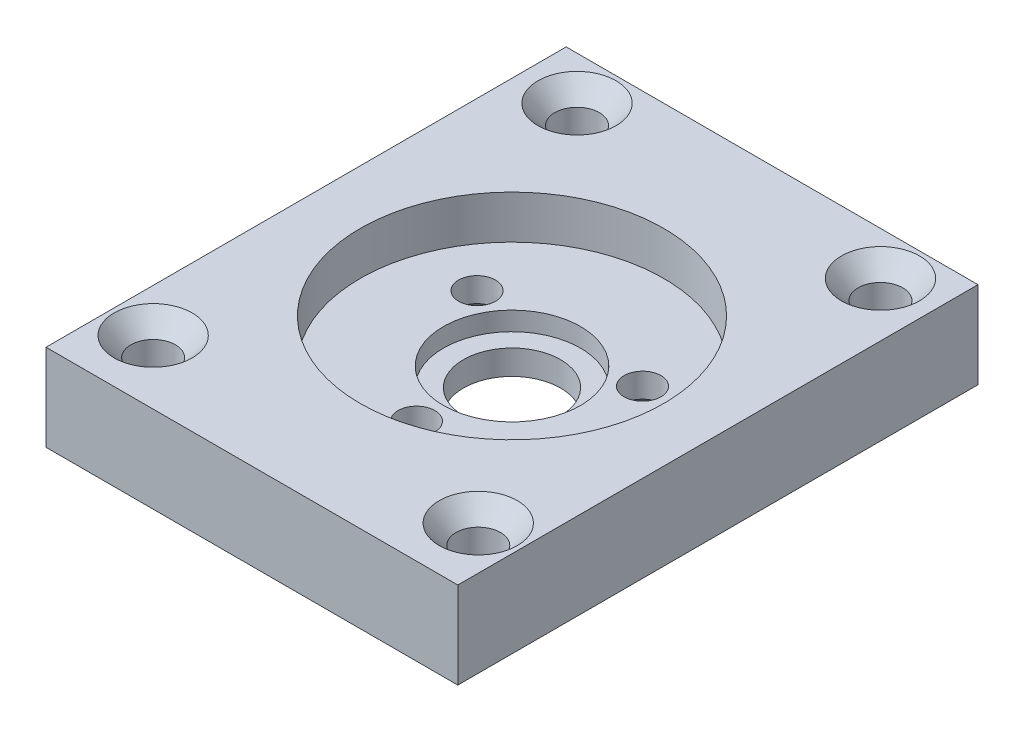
ISO-10303-21;
HEADER;
FILE_DESCRIPTION(('STEP AP214'),'2;1');
FILE_NAME('part.step','',(''),(''),'','','');
FILE_SCHEMA(('AUTOMOTIVE_DESIGN { 1 0 10303 214 1 1 1 1 }'));
ENDSEC;
DATA;
#1=APPLICATION_CONTEXT('core data for automotive mechanical design processes');
#2=APPLICATION_PROTOCOL_DEFINITION('international standard','automotive_design',2000,#1);
#3=PRODUCT_CONTEXT('',#1,'mechanical');
#4=PRODUCT('Part','Part','',(#3));
#5=PRODUCT_RELATED_PRODUCT_CATEGORY('part','',(#4));
#6=PRODUCT_DEFINITION_FORMATION('','',#4);
#7=PRODUCT_DEFINITION_CONTEXT('part definition',#1,'design');
#8=PRODUCT_DEFINITION('design','',#6,#7);
#9=PRODUCT_DEFINITION_SHAPE('','',#8);
#10=(LENGTH_UNIT() NAMED_UNIT(*) SI_UNIT(.MILLI.,.METRE.));
#11=(NAMED_UNIT(*) PLANE_ANGLE_UNIT() SI_UNIT($,.RADIAN.));
#12=(NAMED_UNIT(*) SI_UNIT($,.STERADIAN.) SOLID_ANGLE_UNIT());
#13=UNCERTAINTY_MEASURE_WITH_UNIT(LENGTH_MEASURE(1.E-05),#10,'distance_accuracy_value','');
#14=(GEOMETRIC_REPRESENTATION_CONTEXT(3) GLOBAL_UNCERTAINTY_ASSIGNED_CONTEXT((#13)) GLOBAL_UNIT_ASSIGNED_CONTEXT((#10,
#11,#12)) REPRESENTATION_CONTEXT('',''));
#15=CARTESIAN_POINT('',(0.,0.,0.));
#16=DIRECTION('',(0.,0.,1.));
#17=DIRECTION('',(1.,0.,0.));
#18=AXIS2_PLACEMENT_3D('',#15,#16,#17);
#19=CARTESIAN_POINT('',(15.08125,3.175,19.05));
#20=DIRECTION('',(0.,0.,-1.));
#21=DIRECTION('',(-1.,0.,0.));
#22=AXIS2_PLACEMENT_3D('',#19,#20,#21);
#23=PLANE('',#22);
#24=DIRECTION('',(0.,-1.,0.));
#25=VECTOR('',#24,1.);
#26=CARTESIAN_POINT('',(-15.08125,3.175,19.05));
#27=LINE('',#26,#25);
#28=CARTESIAN_POINT('',(-15.08125,3.175,19.05));
#29=VERTEX_POINT('',#28);
#30=CARTESIAN_POINT('',(-15.08125,-3.17499999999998,19.05));
#31=VERTEX_POINT('',#30);
#32=EDGE_CURVE('E104',#29,#31,#27,.T.);
#33=ORIENTED_EDGE('',*,*,#32,.T.);
#34=DIRECTION('',(-1.,0.,0.));
#35=VECTOR('',#34,1.);
#36=CARTESIAN_POINT('',(15.08125,-3.17499999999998,19.05));
#37=LINE('',#36,#35);
#38=CARTESIAN_POINT('',(15.08125,-3.17499999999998,19.05));
#39=VERTEX_POINT('',#38);
#40=EDGE_CURVE('E11',#39,#31,#37,.T.);
#41=ORIENTED_EDGE('',*,*,#40,.F.);
#42=DIRECTION('',(0.,-1.,0.));
#43=VECTOR('',#42,1.);
#44=CARTESIAN_POINT('',(15.08125,3.175,19.05));
#45=LINE('',#44,#43);
#46=CARTESIAN_POINT('',(15.08125,3.175,19.05));
#47=VERTEX_POINT('',#46);
#48=EDGE_CURVE('E91',#47,#39,#45,.T.);
#49=ORIENTED_EDGE('',*,*,#48,.F.);
#50=DIRECTION('',(-1.,0.,0.));
#51=VECTOR('',#50,1.);
#52=CARTESIAN_POINT('',(15.08125,3.175,19.05));
#53=LINE('',#52,#51);
#54=EDGE_CURVE('E100',#47,#29,#53,.T.);
#55=ORIENTED_EDGE('',*,*,#54,.T.);
#56=EDGE_LOOP('',(#33,#41,#49,#55));
#57=FACE_BOUND('',#56,.T.);
#58=ADVANCED_FACE('F38',(#57),#23,.F.);
#59=CARTESIAN_POINT('',(15.08125,-3.17499999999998,19.05));
#60=DIRECTION('',(0.,1.,0.));
#61=DIRECTION('',(0.,0.,1.));
#62=AXIS2_PLACEMENT_3D('',#59,#60,#61);
#63=PLANE('',#62);
#64=CARTESIAN_POINT('',(11.1125,-3.1749999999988,-15.875));
#65=DIRECTION('',(0.,1.,0.));
#66=DIRECTION('',(0.,0.,1.));
#67=AXIS2_PLACEMENT_3D('',#64,#65,#66);
#68=CIRCLE('',#67,1.63195);
#69=CARTESIAN_POINT('',(11.1125,-3.1749999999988,-14.24305));
#70=VERTEX_POINT('',#69);
#71=EDGE_CURVE('E263',#70,#70,#68,.T.);
#72=ORIENTED_EDGE('',*,*,#71,.T.);
#73=EDGE_LOOP('',(#72));
#74=FACE_BOUND('',#73,.T.);
#75=CARTESIAN_POINT('',(-11.1125,-3.1749999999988,-15.875));
#76=DIRECTION('',(0.,1.,0.));
#77=DIRECTION('',(0.,0.,1.));
#78=AXIS2_PLACEMENT_3D('',#75,#76,#77);
#79=CIRCLE('',#78,1.63195);
#80=CARTESIAN_POINT('',(-11.1125,-3.1749999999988,-14.24305));
#81=VERTEX_POINT('',#80);
#82=EDGE_CURVE('E274',#81,#81,#79,.T.);
#83=ORIENTED_EDGE('',*,*,#82,.T.);
#84=EDGE_LOOP('',(#83));
#85=FACE_BOUND('',#84,.T.);
#86=CARTESIAN_POINT('',(11.90625,-3.175,14.3764));
#87=DIRECTION('',(0.,1.,0.));
#88=DIRECTION('',(0.,0.,1.));
#89=AXIS2_PLACEMENT_3D('',#86,#87,#88);
#90=CIRCLE('',#89,1.63195);
#91=CARTESIAN_POINT('',(11.90625,-3.175,16.00835));
#92=VERTEX_POINT('',#91);
#93=EDGE_CURVE('E283',#92,#92,#90,.T.);
#94=ORIENTED_EDGE('',*,*,#93,.T.);
#95=EDGE_LOOP('',(#94));
#96=FACE_BOUND('',#95,.T.);
#97=CARTESIAN_POINT('',(-11.90625,-3.175,14.3764));
#98=DIRECTION('',(0.,1.,0.));
#99=DIRECTION('',(0.,0.,1.));
#100=AXIS2_PLACEMENT_3D('',#97,#98,#99);
#101=CIRCLE('',#100,1.63195);
#102=CARTESIAN_POINT('',(-11.90625,-3.175,16.00835));
#103=VERTEX_POINT('',#102);
#104=EDGE_CURVE('E292',#103,#103,#101,.T.);
#105=ORIENTED_EDGE('',*,*,#104,.T.);
#106=EDGE_LOOP('',(#105));
#107=FACE_BOUND('',#106,.T.);
#108=CARTESIAN_POINT('',(6.06018596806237,-3.17499999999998,-3.49885));
#109=DIRECTION('',(0.,-1.,0.));
#110=DIRECTION('',(0.,0.,-1.));
#111=AXIS2_PLACEMENT_3D('',#108,#109,#110);
#112=CIRCLE('',#111,2.75);
#113=CARTESIAN_POINT('',(6.06018596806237,-3.17499999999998,-6.24885));
#114=VERTEX_POINT('',#113);
#115=EDGE_CURVE('E297',#114,#114,#112,.T.);
#116=ORIENTED_EDGE('',*,*,#115,.F.);
#117=EDGE_LOOP('',(#116));
#118=FACE_BOUND('',#117,.T.);
#119=CARTESIAN_POINT('',(-6.06018596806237,-3.17499999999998,-3.49885));
#120=DIRECTION('',(0.,-1.,0.));
#121=DIRECTION('',(0.,0.,-1.));
#122=AXIS2_PLACEMENT_3D('',#119,#120,#121);
#123=CIRCLE('',#122,2.75);
#124=CARTESIAN_POINT('',(-6.06018596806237,-3.17499999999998,-6.24885));
#125=VERTEX_POINT('',#124);
#126=EDGE_CURVE('E120',#125,#125,#123,.T.);
#127=ORIENTED_EDGE('',*,*,#126,.F.);
#128=EDGE_LOOP('',(#127));
#129=FACE_BOUND('',#128,.T.);
#130=CARTESIAN_POINT('',(0.,-3.17499999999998,6.9977));
#131=DIRECTION('',(0.,-1.,0.));
#132=DIRECTION('',(0.,0.,-1.));
#133=AXIS2_PLACEMENT_3D('',#130,#131,#132);
#134=CIRCLE('',#133,2.75);
#135=CARTESIAN_POINT('',(0.,-3.17499999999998,4.2477));
#136=VERTEX_POINT('',#135);
#137=EDGE_CURVE('E116',#136,#136,#134,.T.);
#138=ORIENTED_EDGE('',*,*,#137,.F.);
#139=EDGE_LOOP('',(#138));
#140=FACE_BOUND('',#139,.T.);
#141=CARTESIAN_POINT('',(0.,-3.17499999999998,0.));
#142=DIRECTION('',(0.,1.,0.));
#143=DIRECTION('',(0.,0.,1.));
#144=AXIS2_PLACEMENT_3D('',#141,#142,#143);
#145=CIRCLE('',#144,3.556);
#146=CARTESIAN_POINT('',(0.,-3.17499999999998,3.556));
#147=VERTEX_POINT('',#146);
#148=EDGE_CURVE('E138',#147,#147,#145,.F.);
#149=ORIENTED_EDGE('',*,*,#148,.F.);
#150=EDGE_LOOP('',(#149));
#151=FACE_BOUND('',#150,.T.);
#152=DIRECTION('',(0.,0.,-1.));
#153=VECTOR('',#152,1.);
#154=CARTESIAN_POINT('',(-15.08125,-3.17499999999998,19.05));
#155=LINE('',#154,#153);
#156=CARTESIAN_POINT('',(-15.08125,-3.17499999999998,-19.0499999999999));
#157=VERTEX_POINT('',#156);
#158=EDGE_CURVE('E95',#31,#157,#155,.T.);
#159=ORIENTED_EDGE('',*,*,#158,.T.);
#160=DIRECTION('',(-1.,0.,0.));
#161=VECTOR('',#160,1.);
#162=CARTESIAN_POINT('',(15.08125,-3.17499999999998,-19.0499999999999));
#163=LINE('',#162,#161);
#164=CARTESIAN_POINT('',(15.08125,-3.17499999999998,-19.0499999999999));
#165=VERTEX_POINT('',#164);
#166=EDGE_CURVE('E47',#165,#157,#163,.T.);
#167=ORIENTED_EDGE('',*,*,#166,.F.);
#168=DIRECTION('',(0.,0.,-1.));
#169=VECTOR('',#168,1.);
#170=CARTESIAN_POINT('',(15.08125,-3.17499999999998,19.05));
#171=LINE('',#170,#169);
#172=EDGE_CURVE('E86',#39,#165,#171,.T.);
#173=ORIENTED_EDGE('',*,*,#172,.F.);
#174=ORIENTED_EDGE('',*,*,#40,.T.);
#175=EDGE_LOOP('',(#159,#167,#173,#174));
#176=FACE_BOUND('',#175,.T.);
#177=ADVANCED_FACE('F94',(#74,#85,#96,#107,#118,#129,#140,#151,#176),#63,.F.);
#178=CARTESIAN_POINT('',(15.08125,3.17500000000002,-19.0499999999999));
#179=DIRECTION('',(0.,0.,1.));
#180=DIRECTION('',(1.,0.,0.));
#181=AXIS2_PLACEMENT_3D('',#178,#179,#180);
#182=PLANE('',#181);
#183=DIRECTION('',(0.,1.,0.));
#184=VECTOR('',#183,1.);
#185=CARTESIAN_POINT('',(-15.08125,3.17500000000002,-19.0499999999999));
#186=LINE('',#185,#184);
#187=CARTESIAN_POINT('',(-15.08125,3.17500000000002,-19.0499999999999));
#188=VERTEX_POINT('',#187);
#189=EDGE_CURVE('E73',#157,#188,#186,.T.);
#190=ORIENTED_EDGE('',*,*,#189,.T.);
#191=DIRECTION('',(-1.,0.,0.));
#192=VECTOR('',#191,1.);
#193=CARTESIAN_POINT('',(15.08125,3.17500000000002,-19.0499999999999));
#194=LINE('',#193,#192);
#195=CARTESIAN_POINT('',(15.08125,3.17500000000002,-19.0499999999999));
#196=VERTEX_POINT('',#195);
#197=EDGE_CURVE('E96',#196,#188,#194,.T.);
#198=ORIENTED_EDGE('',*,*,#197,.F.);
#199=DIRECTION('',(0.,1.,0.));
#200=VECTOR('',#199,1.);
#201=CARTESIAN_POINT('',(15.08125,3.17500000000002,-19.0499999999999));
#202=LINE('',#201,#200);
#203=EDGE_CURVE('E89',#165,#196,#202,.T.);
#204=ORIENTED_EDGE('',*,*,#203,.F.);
#205=ORIENTED_EDGE('',*,*,#166,.T.);
#206=EDGE_LOOP('',(#190,#198,#204,#205));
#207=FACE_BOUND('',#206,.T.);
#208=ADVANCED_FACE('F98',(#207),#182,.F.);
#209=CARTESIAN_POINT('',(15.08125,3.175,19.05));
#210=DIRECTION('',(0.,-1.,0.));
#211=DIRECTION('',(0.,0.,-1.));
#212=AXIS2_PLACEMENT_3D('',#209,#210,#211);
#213=PLANE('',#212);
#214=CARTESIAN_POINT('',(11.1125,3.17500000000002,-15.875));
#215=DIRECTION('',(0.,1.,0.));
#216=DIRECTION('',(0.,0.,1.));
#217=AXIS2_PLACEMENT_3D('',#214,#215,#216);
#218=CIRCLE('',#217,2.8575);
#219=CARTESIAN_POINT('',(11.1125,3.17500000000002,-13.0175));
#220=VERTEX_POINT('',#219);
#221=EDGE_CURVE('E261',#220,#220,#218,.T.);
#222=ORIENTED_EDGE('',*,*,#221,.F.);
#223=EDGE_LOOP('',(#222));
#224=FACE_BOUND('',#223,.T.);
#225=CARTESIAN_POINT('',(-11.1125,3.17500000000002,-15.875));
#226=DIRECTION('',(0.,1.,0.));
#227=DIRECTION('',(0.,0.,1.));
#228=AXIS2_PLACEMENT_3D('',#225,#226,#227);
#229=CIRCLE('',#228,2.8575);
#230=CARTESIAN_POINT('',(-11.1125,3.17500000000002,-13.0175));
#231=VERTEX_POINT('',#230);
#232=EDGE_CURVE('E268',#231,#231,#229,.T.);
#233=ORIENTED_EDGE('',*,*,#232,.F.);
#234=EDGE_LOOP('',(#233));
#235=FACE_BOUND('',#234,.T.);
#236=CARTESIAN_POINT('',(11.90625,3.175,14.3764));
#237=DIRECTION('',(0.,1.,0.));
#238=DIRECTION('',(0.,0.,1.));
#239=AXIS2_PLACEMENT_3D('',#236,#237,#238);
#240=CIRCLE('',#239,2.8575);
#241=CARTESIAN_POINT('',(11.90625,3.175,17.2339));
#242=VERTEX_POINT('',#241);
#243=EDGE_CURVE('E277',#242,#242,#240,.T.);
#244=ORIENTED_EDGE('',*,*,#243,.F.);
#245=EDGE_LOOP('',(#244));
#246=FACE_BOUND('',#245,.T.);
#247=CARTESIAN_POINT('',(-11.90625,3.175,14.3764));
#248=DIRECTION('',(0.,1.,0.));
#249=DIRECTION('',(0.,0.,1.));
#250=AXIS2_PLACEMENT_3D('',#247,#248,#249);
#251=CIRCLE('',#250,2.8575);
#252=CARTESIAN_POINT('',(-11.90625,3.175,17.2339));
#253=VERTEX_POINT('',#252);
#254=EDGE_CURVE('E286',#253,#253,#251,.T.);
#255=ORIENTED_EDGE('',*,*,#254,.F.);
#256=EDGE_LOOP('',(#255));
#257=FACE_BOUND('',#256,.T.);
#258=CARTESIAN_POINT('',(0.,3.17500000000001,0.));
#259=DIRECTION('',(0.,1.,0.));
#260=DIRECTION('',(0.,0.,1.));
#261=AXIS2_PLACEMENT_3D('',#258,#259,#260);
#262=CIRCLE('',#261,11.1125);
#263=CARTESIAN_POINT('',(0.,3.175,11.1125));
#264=VERTEX_POINT('',#263);
#265=EDGE_CURVE('E145',#264,#264,#262,.T.);
#266=ORIENTED_EDGE('',*,*,#265,.F.);
#267=EDGE_LOOP('',(#266));
#268=FACE_BOUND('',#267,.T.);
#269=DIRECTION('',(0.,0.,1.));
#270=VECTOR('',#269,1.);
#271=CARTESIAN_POINT('',(-15.08125,3.175,19.05));
#272=LINE('',#271,#270);
#273=EDGE_CURVE('E79',#188,#29,#272,.T.);
#274=ORIENTED_EDGE('',*,*,#273,.T.);
#275=ORIENTED_EDGE('',*,*,#54,.F.);
#276=DIRECTION('',(0.,0.,1.));
#277=VECTOR('',#276,1.);
#278=CARTESIAN_POINT('',(15.08125,3.175,19.05));
#279=LINE('',#278,#277);
#280=EDGE_CURVE('E56',#196,#47,#279,.T.);
#281=ORIENTED_EDGE('',*,*,#280,.F.);
#282=ORIENTED_EDGE('',*,*,#197,.T.);
#283=EDGE_LOOP('',(#274,#275,#281,#282));
#284=FACE_BOUND('',#283,.T.);
#285=ADVANCED_FACE('F155',(#224,#235,#246,#257,#268,#284),#213,.F.);
#286=CARTESIAN_POINT('',(15.08125,-3.17499999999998,19.05));
#287=DIRECTION('',(1.,0.,0.));
#288=DIRECTION('',(0.,0.,-1.));
#289=AXIS2_PLACEMENT_3D('',#286,#287,#288);
#290=PLANE('',#289);
#291=ORIENTED_EDGE('',*,*,#48,.T.);
#292=ORIENTED_EDGE('',*,*,#172,.T.);
#293=ORIENTED_EDGE('',*,*,#203,.T.);
#294=ORIENTED_EDGE('',*,*,#280,.T.);
#295=EDGE_LOOP('',(#291,#292,#293,#294));
#296=FACE_BOUND('',#295,.T.);
#297=ADVANCED_FACE('F87',(#296),#290,.T.);
#298=CARTESIAN_POINT('',(-15.08125,-3.17499999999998,19.05));
#299=DIRECTION('',(1.,0.,0.));
#300=DIRECTION('',(0.,0.,-1.));
#301=AXIS2_PLACEMENT_3D('',#298,#299,#300);
#302=PLANE('',#301);
#303=ORIENTED_EDGE('',*,*,#32,.F.);
#304=ORIENTED_EDGE('',*,*,#273,.F.);
#305=ORIENTED_EDGE('',*,*,#189,.F.);
#306=ORIENTED_EDGE('',*,*,#158,.F.);
#307=EDGE_LOOP('',(#303,#304,#305,#306));
#308=FACE_BOUND('',#307,.T.);
#309=ADVANCED_FACE('F163',(#308),#302,.F.);
#310=CARTESIAN_POINT('',(0.,0.,0.));
#311=DIRECTION('',(0.,1.,0.));
#312=DIRECTION('',(0.,0.,1.));
#313=AXIS2_PLACEMENT_3D('',#310,#311,#312);
#314=CYLINDRICAL_SURFACE('',#313,11.1125);
#315=CARTESIAN_POINT('',(0.,0.,0.));
#316=DIRECTION('',(0.,1.,0.));
#317=DIRECTION('',(0.,0.,1.));
#318=AXIS2_PLACEMENT_3D('',#315,#316,#317);
#319=CIRCLE('',#318,11.1125);
#320=CARTESIAN_POINT('',(0.,0.,11.1125));
#321=VERTEX_POINT('',#320);
#322=EDGE_CURVE('E107',#321,#321,#319,.T.);
#323=ORIENTED_EDGE('',*,*,#322,.F.);
#324=EDGE_LOOP('',(#323));
#325=FACE_BOUND('',#324,.T.);
#326=ORIENTED_EDGE('',*,*,#265,.T.);
#327=EDGE_LOOP('',(#326));
#328=FACE_BOUND('',#327,.T.);
#329=ADVANCED_FACE('F153',(#325,#328),#314,.F.);
#330=CARTESIAN_POINT('',(0.,0.,0.));
#331=DIRECTION('',(0.,1.,0.));
#332=DIRECTION('',(0.,0.,1.));
#333=AXIS2_PLACEMENT_3D('',#330,#331,#332);
#334=PLANE('',#333);
#335=CARTESIAN_POINT('',(6.06018596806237,0.,-3.49885));
#336=DIRECTION('',(0.,1.,0.));
#337=DIRECTION('',(0.,0.,1.));
#338=AXIS2_PLACEMENT_3D('',#335,#336,#337);
#339=CIRCLE('',#338,1.35);
#340=CARTESIAN_POINT('',(6.06018596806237,0.,-2.14885));
#341=VERTEX_POINT('',#340);
#342=EDGE_CURVE('E41',#341,#341,#339,.T.);
#343=ORIENTED_EDGE('',*,*,#342,.F.);
#344=EDGE_LOOP('',(#343));
#345=FACE_BOUND('',#344,.T.);
#346=CARTESIAN_POINT('',(-6.06018596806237,0.,-3.49885));
#347=DIRECTION('',(0.,1.,0.));
#348=DIRECTION('',(0.,0.,1.));
#349=AXIS2_PLACEMENT_3D('',#346,#347,#348);
#350=CIRCLE('',#349,1.35);
#351=CARTESIAN_POINT('',(-6.06018596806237,0.,-2.14885));
#352=VERTEX_POINT('',#351);
#353=EDGE_CURVE('E117',#352,#352,#350,.T.);
#354=ORIENTED_EDGE('',*,*,#353,.F.);
#355=EDGE_LOOP('',(#354));
#356=FACE_BOUND('',#355,.T.);
#357=CARTESIAN_POINT('',(0.,0.,6.9977));
#358=DIRECTION('',(0.,1.,0.));
#359=DIRECTION('',(0.,0.,1.));
#360=AXIS2_PLACEMENT_3D('',#357,#358,#359);
#361=CIRCLE('',#360,1.35);
#362=CARTESIAN_POINT('',(0.,0.,8.3477));
#363=VERTEX_POINT('',#362);
#364=EDGE_CURVE('E113',#363,#363,#361,.T.);
#365=ORIENTED_EDGE('',*,*,#364,.F.);
#366=EDGE_LOOP('',(#365));
#367=FACE_BOUND('',#366,.T.);
#368=CARTESIAN_POINT('',(0.,0.,0.));
#369=DIRECTION('',(0.,1.,0.));
#370=DIRECTION('',(0.,0.,1.));
#371=AXIS2_PLACEMENT_3D('',#368,#369,#370);
#372=CIRCLE('',#371,5.0165);
#373=CARTESIAN_POINT('',(0.,0.,5.0165));
#374=VERTEX_POINT('',#373);
#375=EDGE_CURVE('E141',#374,#374,#372,.T.);
#376=ORIENTED_EDGE('',*,*,#375,.F.);
#377=EDGE_LOOP('',(#376));
#378=FACE_BOUND('',#377,.T.);
#379=ORIENTED_EDGE('',*,*,#322,.T.);
#380=EDGE_LOOP('',(#379));
#381=FACE_BOUND('',#380,.T.);
#382=ADVANCED_FACE('F181',(#345,#356,#367,#378,#381),#334,.T.);
#383=CARTESIAN_POINT('',(0.,-1.3716,0.));
#384=DIRECTION('',(0.,1.,0.));
#385=DIRECTION('',(0.,0.,1.));
#386=AXIS2_PLACEMENT_3D('',#383,#384,#385);
#387=CYLINDRICAL_SURFACE('',#386,5.0165);
#388=CARTESIAN_POINT('',(0.,-1.3716,0.));
#389=DIRECTION('',(0.,1.,0.));
#390=DIRECTION('',(0.,0.,1.));
#391=AXIS2_PLACEMENT_3D('',#388,#389,#390);
#392=CIRCLE('',#391,5.0165);
#393=CARTESIAN_POINT('',(0.,-1.3716,5.0165));
#394=VERTEX_POINT('',#393);
#395=EDGE_CURVE('E142',#394,#394,#392,.T.);
#396=ORIENTED_EDGE('',*,*,#395,.F.);
#397=EDGE_LOOP('',(#396));
#398=FACE_BOUND('',#397,.T.);
#399=ORIENTED_EDGE('',*,*,#375,.T.);
#400=EDGE_LOOP('',(#399));
#401=FACE_BOUND('',#400,.T.);
#402=ADVANCED_FACE('F187',(#398,#401),#387,.F.);
#403=CARTESIAN_POINT('',(0.,-1.3716,0.));
#404=DIRECTION('',(0.,1.,0.));
#405=DIRECTION('',(0.,0.,1.));
#406=AXIS2_PLACEMENT_3D('',#403,#404,#405);
#407=PLANE('',#406);
#408=CARTESIAN_POINT('',(0.,-1.3716,0.));
#409=DIRECTION('',(0.,1.,0.));
#410=DIRECTION('',(0.,0.,1.));
#411=AXIS2_PLACEMENT_3D('',#408,#409,#410);
#412=CIRCLE('',#411,3.556);
#413=CARTESIAN_POINT('',(0.,-1.3716,3.556));
#414=VERTEX_POINT('',#413);
#415=EDGE_CURVE('E115',#414,#414,#412,.T.);
#416=ORIENTED_EDGE('',*,*,#415,.F.);
#417=EDGE_LOOP('',(#416));
#418=FACE_BOUND('',#417,.T.);
#419=ORIENTED_EDGE('',*,*,#395,.T.);
#420=EDGE_LOOP('',(#419));
#421=FACE_BOUND('',#420,.T.);
#422=ADVANCED_FACE('F191',(#418,#421),#407,.T.);
#423=CARTESIAN_POINT('',(0.,-3.17599999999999,0.));
#424=DIRECTION('',(0.,1.,0.));
#425=DIRECTION('',(0.,0.,1.));
#426=AXIS2_PLACEMENT_3D('',#423,#424,#425);
#427=CYLINDRICAL_SURFACE('',#426,3.556);
#428=ORIENTED_EDGE('',*,*,#415,.T.);
#429=EDGE_LOOP('',(#428));
#430=FACE_BOUND('',#429,.T.);
#431=ORIENTED_EDGE('',*,*,#148,.T.);
#432=EDGE_LOOP('',(#431));
#433=FACE_BOUND('',#432,.T.);
#434=ADVANCED_FACE('F195',(#430,#433),#427,.F.);
#435=CARTESIAN_POINT('',(0.,-3.17499999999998,6.9977));
#436=DIRECTION('',(0.,-1.,0.));
#437=DIRECTION('',(0.,0.,-1.));
#438=AXIS2_PLACEMENT_3D('',#435,#436,#437);
#439=CONICAL_SURFACE('',#438,2.75,0.785398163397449);
#440=CARTESIAN_POINT('',(0.,-1.77499999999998,6.9977));
#441=DIRECTION('',(0.,-1.,0.));
#442=DIRECTION('',(0.,0.,-1.));
#443=AXIS2_PLACEMENT_3D('',#440,#441,#442);
#444=CIRCLE('',#443,1.35);
#445=CARTESIAN_POINT('',(0.,-1.77499999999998,5.6477));
#446=VERTEX_POINT('',#445);
#447=EDGE_CURVE('E119',#446,#446,#444,.T.);
#448=ORIENTED_EDGE('',*,*,#447,.F.);
#449=EDGE_LOOP('',(#448));
#450=FACE_BOUND('',#449,.T.);
#451=ORIENTED_EDGE('',*,*,#137,.T.);
#452=EDGE_LOOP('',(#451));
#453=FACE_BOUND('',#452,.T.);
#454=ADVANCED_FACE('F199',(#450,#453),#439,.F.);
#455=CARTESIAN_POINT('',(0.,-3.17499999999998,6.9977));
#456=DIRECTION('',(0.,-1.,0.));
#457=DIRECTION('',(0.,0.,-1.));
#458=AXIS2_PLACEMENT_3D('',#455,#456,#457);
#459=CYLINDRICAL_SURFACE('',#458,1.35);
#460=ORIENTED_EDGE('',*,*,#364,.T.);
#461=EDGE_LOOP('',(#460));
#462=FACE_BOUND('',#461,.T.);
#463=ORIENTED_EDGE('',*,*,#447,.T.);
#464=EDGE_LOOP('',(#463));
#465=FACE_BOUND('',#464,.T.);
#466=ADVANCED_FACE('F203',(#462,#465),#459,.F.);
#467=CARTESIAN_POINT('',(-6.06018596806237,-3.17499999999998,-3.49885));
#468=DIRECTION('',(0.,-1.,0.));
#469=DIRECTION('',(0.,0.,-1.));
#470=AXIS2_PLACEMENT_3D('',#467,#468,#469);
#471=CONICAL_SURFACE('',#470,2.75,0.785398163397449);
#472=CARTESIAN_POINT('',(-6.06018596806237,-1.77499999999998,-3.49885));
#473=DIRECTION('',(0.,-1.,0.));
#474=DIRECTION('',(0.,0.,-1.));
#475=AXIS2_PLACEMENT_3D('',#472,#473,#474);
#476=CIRCLE('',#475,1.35);
#477=CARTESIAN_POINT('',(-6.06018596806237,-1.77499999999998,-4.84885));
#478=VERTEX_POINT('',#477);
#479=EDGE_CURVE('E126',#478,#478,#476,.T.);
#480=ORIENTED_EDGE('',*,*,#479,.F.);
#481=EDGE_LOOP('',(#480));
#482=FACE_BOUND('',#481,.T.);
#483=ORIENTED_EDGE('',*,*,#126,.T.);
#484=EDGE_LOOP('',(#483));
#485=FACE_BOUND('',#484,.T.);
#486=ADVANCED_FACE('F207',(#482,#485),#471,.F.);
#487=CARTESIAN_POINT('',(-6.06018596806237,-3.17499999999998,-3.49885));
#488=DIRECTION('',(0.,-1.,0.));
#489=DIRECTION('',(0.,0.,-1.));
#490=AXIS2_PLACEMENT_3D('',#487,#488,#489);
#491=CYLINDRICAL_SURFACE('',#490,1.35);
#492=ORIENTED_EDGE('',*,*,#353,.T.);
#493=EDGE_LOOP('',(#492));
#494=FACE_BOUND('',#493,.T.);
#495=ORIENTED_EDGE('',*,*,#479,.T.);
#496=EDGE_LOOP('',(#495));
#497=FACE_BOUND('',#496,.T.);
#498=ADVANCED_FACE('F211',(#494,#497),#491,.F.);
#499=CARTESIAN_POINT('',(6.06018596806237,-3.17499999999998,-3.49885));
#500=DIRECTION('',(0.,-1.,0.));
#501=DIRECTION('',(0.,0.,-1.));
#502=AXIS2_PLACEMENT_3D('',#499,#500,#501);
#503=CONICAL_SURFACE('',#502,2.75,0.785398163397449);
#504=CARTESIAN_POINT('',(6.06018596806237,-1.77499999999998,-3.49885));
#505=DIRECTION('',(0.,-1.,0.));
#506=DIRECTION('',(0.,0.,-1.));
#507=AXIS2_PLACEMENT_3D('',#504,#505,#506);
#508=CIRCLE('',#507,1.35);
#509=CARTESIAN_POINT('',(6.06018596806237,-1.77499999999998,-4.84885));
#510=VERTEX_POINT('',#509);
#511=EDGE_CURVE('E295',#510,#510,#508,.T.);
#512=ORIENTED_EDGE('',*,*,#511,.F.);
#513=EDGE_LOOP('',(#512));
#514=FACE_BOUND('',#513,.T.);
#515=ORIENTED_EDGE('',*,*,#115,.T.);
#516=EDGE_LOOP('',(#515));
#517=FACE_BOUND('',#516,.T.);
#518=ADVANCED_FACE('F215',(#514,#517),#503,.F.);
#519=CARTESIAN_POINT('',(6.06018596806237,-3.17499999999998,-3.49885));
#520=DIRECTION('',(0.,-1.,0.));
#521=DIRECTION('',(0.,0.,-1.));
#522=AXIS2_PLACEMENT_3D('',#519,#520,#521);
#523=CYLINDRICAL_SURFACE('',#522,1.35);
#524=ORIENTED_EDGE('',*,*,#342,.T.);
#525=EDGE_LOOP('',(#524));
#526=FACE_BOUND('',#525,.T.);
#527=ORIENTED_EDGE('',*,*,#511,.T.);
#528=EDGE_LOOP('',(#527));
#529=FACE_BOUND('',#528,.T.);
#530=ADVANCED_FACE('F218',(#526,#529),#523,.F.);
#531=CARTESIAN_POINT('',(-11.90625,3.175,14.3764));
#532=DIRECTION('',(0.,1.,0.));
#533=DIRECTION('',(0.,0.,1.));
#534=AXIS2_PLACEMENT_3D('',#531,#532,#533);
#535=CYLINDRICAL_SURFACE('',#534,1.63195);
#536=ORIENTED_EDGE('',*,*,#104,.F.);
#537=EDGE_LOOP('',(#536));
#538=FACE_BOUND('',#537,.T.);
#539=CARTESIAN_POINT('',(-11.90625,1.76516599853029,14.3764));
#540=DIRECTION('',(0.,1.,0.));
#541=DIRECTION('',(0.,0.,1.));
#542=AXIS2_PLACEMENT_3D('',#539,#540,#541);
#543=CIRCLE('',#542,1.63195);
#544=CARTESIAN_POINT('',(-11.90625,1.76516599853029,16.00835));
#545=VERTEX_POINT('',#544);
#546=EDGE_CURVE('E289',#545,#545,#543,.T.);
#547=ORIENTED_EDGE('',*,*,#546,.T.);
#548=EDGE_LOOP('',(#547));
#549=FACE_BOUND('',#548,.T.);
#550=ADVANCED_FACE('F222',(#538,#549),#535,.F.);
#551=CARTESIAN_POINT('',(-11.90625,3.175,14.3764));
#552=DIRECTION('',(0.,1.,0.));
#553=DIRECTION('',(0.,0.,1.));
#554=AXIS2_PLACEMENT_3D('',#551,#552,#553);
#555=CONICAL_SURFACE('',#554,2.8575,0.715584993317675);
#556=ORIENTED_EDGE('',*,*,#546,.F.);
#557=EDGE_LOOP('',(#556));
#558=FACE_BOUND('',#557,.T.);
#559=ORIENTED_EDGE('',*,*,#254,.T.);
#560=EDGE_LOOP('',(#559));
#561=FACE_BOUND('',#560,.T.);
#562=ADVANCED_FACE('F226',(#558,#561),#555,.F.);
#563=CARTESIAN_POINT('',(11.90625,3.175,14.3764));
#564=DIRECTION('',(0.,1.,0.));
#565=DIRECTION('',(0.,0.,1.));
#566=AXIS2_PLACEMENT_3D('',#563,#564,#565);
#567=CYLINDRICAL_SURFACE('',#566,1.63195);
#568=ORIENTED_EDGE('',*,*,#93,.F.);
#569=EDGE_LOOP('',(#568));
#570=FACE_BOUND('',#569,.T.);
#571=CARTESIAN_POINT('',(11.90625,1.76516599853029,14.3764));
#572=DIRECTION('',(0.,1.,0.));
#573=DIRECTION('',(0.,0.,1.));
#574=AXIS2_PLACEMENT_3D('',#571,#572,#573);
#575=CIRCLE('',#574,1.63195);
#576=CARTESIAN_POINT('',(11.90625,1.76516599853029,16.00835));
#577=VERTEX_POINT('',#576);
#578=EDGE_CURVE('E280',#577,#577,#575,.T.);
#579=ORIENTED_EDGE('',*,*,#578,.T.);
#580=EDGE_LOOP('',(#579));
#581=FACE_BOUND('',#580,.T.);
#582=ADVANCED_FACE('F230',(#570,#581),#567,.F.);
#583=CARTESIAN_POINT('',(11.90625,3.175,14.3764));
#584=DIRECTION('',(0.,1.,0.));
#585=DIRECTION('',(0.,0.,1.));
#586=AXIS2_PLACEMENT_3D('',#583,#584,#585);
#587=CONICAL_SURFACE('',#586,2.8575,0.715584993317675);
#588=ORIENTED_EDGE('',*,*,#578,.F.);
#589=EDGE_LOOP('',(#588));
#590=FACE_BOUND('',#589,.T.);
#591=ORIENTED_EDGE('',*,*,#243,.T.);
#592=EDGE_LOOP('',(#591));
#593=FACE_BOUND('',#592,.T.);
#594=ADVANCED_FACE('F234',(#590,#593),#587,.F.);
#595=CARTESIAN_POINT('',(-11.1125,3.17500000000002,-15.875));
#596=DIRECTION('',(0.,1.,0.));
#597=DIRECTION('',(0.,0.,1.));
#598=AXIS2_PLACEMENT_3D('',#595,#596,#597);
#599=CYLINDRICAL_SURFACE('',#598,1.63195);
#600=ORIENTED_EDGE('',*,*,#82,.F.);
#601=EDGE_LOOP('',(#600));
#602=FACE_BOUND('',#601,.T.);
#603=CARTESIAN_POINT('',(-11.1125,1.76516599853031,-15.875));
#604=DIRECTION('',(0.,1.,0.));
#605=DIRECTION('',(0.,0.,1.));
#606=AXIS2_PLACEMENT_3D('',#603,#604,#605);
#607=CIRCLE('',#606,1.63195);
#608=CARTESIAN_POINT('',(-11.1125,1.76516599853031,-14.24305));
#609=VERTEX_POINT('',#608);
#610=EDGE_CURVE('E271',#609,#609,#607,.T.);
#611=ORIENTED_EDGE('',*,*,#610,.T.);
#612=EDGE_LOOP('',(#611));
#613=FACE_BOUND('',#612,.T.);
#614=ADVANCED_FACE('F238',(#602,#613),#599,.F.);
#615=CARTESIAN_POINT('',(-11.1125,3.17500000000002,-15.875));
#616=DIRECTION('',(0.,1.,0.));
#617=DIRECTION('',(0.,0.,1.));
#618=AXIS2_PLACEMENT_3D('',#615,#616,#617);
#619=CONICAL_SURFACE('',#618,2.8575,0.715584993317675);
#620=ORIENTED_EDGE('',*,*,#610,.F.);
#621=EDGE_LOOP('',(#620));
#622=FACE_BOUND('',#621,.T.);
#623=ORIENTED_EDGE('',*,*,#232,.T.);
#624=EDGE_LOOP('',(#623));
#625=FACE_BOUND('',#624,.T.);
#626=ADVANCED_FACE('F242',(#622,#625),#619,.F.);
#627=CARTESIAN_POINT('',(11.1125,3.17500000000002,-15.875));
#628=DIRECTION('',(0.,1.,0.));
#629=DIRECTION('',(0.,0.,1.));
#630=AXIS2_PLACEMENT_3D('',#627,#628,#629);
#631=CYLINDRICAL_SURFACE('',#630,1.63195);
#632=ORIENTED_EDGE('',*,*,#71,.F.);
#633=EDGE_LOOP('',(#632));
#634=FACE_BOUND('',#633,.T.);
#635=CARTESIAN_POINT('',(11.1125,1.76516599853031,-15.875));
#636=DIRECTION('',(0.,1.,0.));
#637=DIRECTION('',(0.,0.,1.));
#638=AXIS2_PLACEMENT_3D('',#635,#636,#637);
#639=CIRCLE('',#638,1.63195);
#640=CARTESIAN_POINT('',(11.1125,1.76516599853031,-14.24305));
#641=VERTEX_POINT('',#640);
#642=EDGE_CURVE('E259',#641,#641,#639,.T.);
#643=ORIENTED_EDGE('',*,*,#642,.T.);
#644=EDGE_LOOP('',(#643));
#645=FACE_BOUND('',#644,.T.);
#646=ADVANCED_FACE('F246',(#634,#645),#631,.F.);
#647=CARTESIAN_POINT('',(11.1125,3.17500000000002,-15.875));
#648=DIRECTION('',(0.,1.,0.));
#649=DIRECTION('',(0.,0.,1.));
#650=AXIS2_PLACEMENT_3D('',#647,#648,#649);
#651=CONICAL_SURFACE('',#650,2.8575,0.715584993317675);
#652=ORIENTED_EDGE('',*,*,#642,.F.);
#653=EDGE_LOOP('',(#652));
#654=FACE_BOUND('',#653,.T.);
#655=ORIENTED_EDGE('',*,*,#221,.T.);
#656=EDGE_LOOP('',(#655));
#657=FACE_BOUND('',#656,.T.);
#658=ADVANCED_FACE('F250',(#654,#657),#651,.F.);
#659=CLOSED_SHELL('',(#58,#177,#208,#285,#297,#309,#329,#382,#402,#422,#434,#454,#466,#486,#498,
#518,#530,#550,#562,#582,#594,#614,#626,#646,#658));
#660=MANIFOLD_SOLID_BREP('B2',#659);
#661=ADVANCED_BREP_SHAPE_REPRESENTATION('',(#18,#660),#14);
#662=SHAPE_DEFINITION_REPRESENTATION(#9,#661);
ENDSEC;
END-ISO-10303-21;
